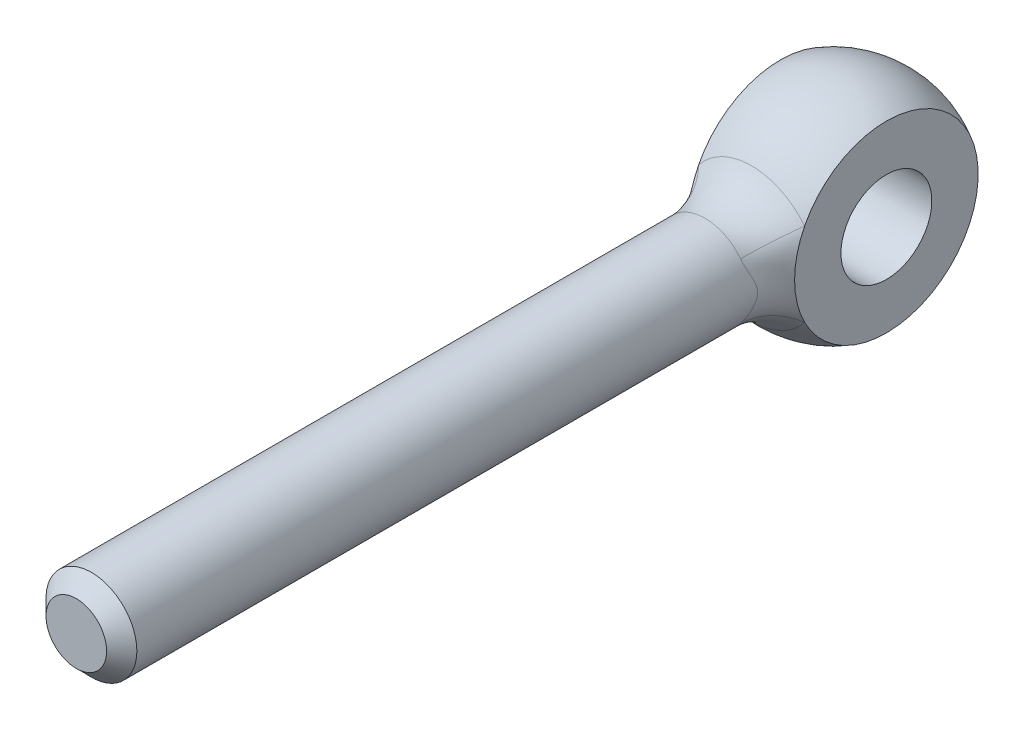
ISO-10303-21;
HEADER;
FILE_DESCRIPTION(('STEP AP214'),'2;1');
FILE_NAME('part.step','',(''),(''),'','','');
FILE_SCHEMA(('AUTOMOTIVE_DESIGN { 1 0 10303 214 1 1 1 1 }'));
ENDSEC;
DATA;
#1=APPLICATION_CONTEXT('core data for automotive mechanical design processes');
#2=APPLICATION_PROTOCOL_DEFINITION('international standard','automotive_design',2000,#1);
#3=PRODUCT_CONTEXT('',#1,'mechanical');
#4=PRODUCT('Part','Part','',(#3));
#5=PRODUCT_RELATED_PRODUCT_CATEGORY('part','',(#4));
#6=PRODUCT_DEFINITION_FORMATION('','',#4);
#7=PRODUCT_DEFINITION_CONTEXT('part definition',#1,'design');
#8=PRODUCT_DEFINITION('design','',#6,#7);
#9=PRODUCT_DEFINITION_SHAPE('','',#8);
#10=(LENGTH_UNIT() NAMED_UNIT(*) SI_UNIT(.MILLI.,.METRE.));
#11=(NAMED_UNIT(*) PLANE_ANGLE_UNIT() SI_UNIT($,.RADIAN.));
#12=(NAMED_UNIT(*) SI_UNIT($,.STERADIAN.) SOLID_ANGLE_UNIT());
#13=UNCERTAINTY_MEASURE_WITH_UNIT(LENGTH_MEASURE(1.E-05),#10,'distance_accuracy_value','');
#14=(GEOMETRIC_REPRESENTATION_CONTEXT(3) GLOBAL_UNCERTAINTY_ASSIGNED_CONTEXT((#13)) GLOBAL_UNIT_ASSIGNED_CONTEXT((#10,
#11,#12)) REPRESENTATION_CONTEXT('',''));
#15=CARTESIAN_POINT('',(0.,0.,0.));
#16=DIRECTION('',(0.,0.,1.));
#17=DIRECTION('',(1.,0.,0.));
#18=AXIS2_PLACEMENT_3D('',#15,#16,#17);
#19=CARTESIAN_POINT('',(0.,0.,0.));
#20=DIRECTION('',(-1.,0.,0.));
#21=DIRECTION('',(0.,0.,-1.));
#22=AXIS2_PLACEMENT_3D('',#19,#20,#21);
#23=SPHERICAL_SURFACE('',#22,7.);
#24=CARTESIAN_POINT('',(3.5,0.,0.));
#25=DIRECTION('',(1.,0.,0.));
#26=DIRECTION('',(0.,0.,1.));
#27=AXIS2_PLACEMENT_3D('',#24,#25,#26);
#28=CIRCLE('',#27,6.06217782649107);
#29=CARTESIAN_POINT('',(3.5,2.75553537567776,5.39972451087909));
#30=VERTEX_POINT('',#29);
#31=CARTESIAN_POINT('',(3.5,-2.75553537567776,5.39972451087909));
#32=VERTEX_POINT('',#31);
#33=EDGE_CURVE('E64',#30,#32,#28,.F.);
#34=ORIENTED_EDGE('',*,*,#33,.T.);
#35=CARTESIAN_POINT('',(0.,0.,5.39972451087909));
#36=DIRECTION('',(0.,0.,-1.));
#37=DIRECTION('',(1.,0.,0.));
#38=AXIS2_PLACEMENT_3D('',#35,#36,#37);
#39=CIRCLE('',#38,4.45454545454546);
#40=CARTESIAN_POINT('',(-3.5,-2.75553537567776,5.39972451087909));
#41=VERTEX_POINT('',#40);
#42=EDGE_CURVE('E72',#32,#41,#39,.T.);
#43=ORIENTED_EDGE('',*,*,#42,.T.);
#44=CARTESIAN_POINT('',(-3.5,0.,0.));
#45=DIRECTION('',(1.,0.,0.));
#46=DIRECTION('',(0.,0.,1.));
#47=AXIS2_PLACEMENT_3D('',#44,#45,#46);
#48=CIRCLE('',#47,6.06217782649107);
#49=CARTESIAN_POINT('',(-3.5,2.75553537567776,5.39972451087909));
#50=VERTEX_POINT('',#49);
#51=EDGE_CURVE('E60',#50,#41,#48,.F.);
#52=ORIENTED_EDGE('',*,*,#51,.F.);
#53=CARTESIAN_POINT('',(0.,0.,5.39972451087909));
#54=DIRECTION('',(0.,0.,-1.));
#55=DIRECTION('',(1.,0.,0.));
#56=AXIS2_PLACEMENT_3D('',#53,#54,#55);
#57=CIRCLE('',#56,4.45454545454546);
#58=EDGE_CURVE('E69',#50,#30,#57,.T.);
#59=ORIENTED_EDGE('',*,*,#58,.T.);
#60=EDGE_LOOP('',(#34,#43,#52,#59));
#61=FACE_BOUND('',#60,.T.);
#62=ADVANCED_FACE('F14',(#61),#23,.T.);
#63=CARTESIAN_POINT('',(0.,0.,-10.));
#64=DIRECTION('',(0.,0.,-1.));
#65=DIRECTION('',(1.,0.,0.));
#66=AXIS2_PLACEMENT_3D('',#63,#64,#65);
#67=CYLINDRICAL_SURFACE('',#66,3.);
#68=CARTESIAN_POINT('',(3.5,3.2355782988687,5.12650300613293));
#69=CARTESIAN_POINT('',(2.21863331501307,2.04715505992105,6.30296014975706));
#70=CARTESIAN_POINT('',(1.96436370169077,2.26743803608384,8.38265343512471));
#71=CARTESIAN_POINT('',(3.5,3.19913440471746,5.14950105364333));
#72=CARTESIAN_POINT('',(2.22557997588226,2.03413369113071,6.33043158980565));
#73=CARTESIAN_POINT('',(2.00002659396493,2.23654422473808,8.40046287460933));
#74=CARTESIAN_POINT('',(3.5,3.16190695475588,5.17245733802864));
#75=CARTESIAN_POINT('',(2.23371605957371,2.02068666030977,6.35734290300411));
#76=CARTESIAN_POINT('',(2.0350744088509,2.20470514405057,8.41580330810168));
#77=CARTESIAN_POINT('',(3.5,3.08569578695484,5.2182818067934));
#78=CARTESIAN_POINT('',(2.25234735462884,1.99246404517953,6.40983640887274));
#79=CARTESIAN_POINT('',(2.10377448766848,2.13924810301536,8.44176635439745));
#80=CARTESIAN_POINT('',(3.5,3.04671284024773,5.24115002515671));
#81=CARTESIAN_POINT('',(2.26283033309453,1.97769838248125,6.43541471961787));
#82=CARTESIAN_POINT('',(2.13742735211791,2.10563092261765,8.45239101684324));
#83=CARTESIAN_POINT('',(3.5,2.92713810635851,5.30945187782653));
#84=CARTESIAN_POINT('',(2.29762891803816,1.9308753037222,6.50965537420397));
#85=CARTESIAN_POINT('',(2.23581231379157,2.00253050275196,8.47747005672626));
#86=CARTESIAN_POINT('',(3.5,2.84361463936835,5.35477773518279));
#87=CARTESIAN_POINT('',(2.32540834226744,1.89608630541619,6.55631945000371));
#88=CARTESIAN_POINT('',(2.29827584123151,1.93053455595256,8.48527657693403));
#89=CARTESIAN_POINT('',(3.5,2.68828049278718,5.43404462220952));
#90=CARTESIAN_POINT('',(2.38119716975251,1.82520856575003,6.63251730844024));
#91=CARTESIAN_POINT('',(2.40209207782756,1.79867960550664,8.48528503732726));
#92=CARTESIAN_POINT('',(3.5,2.61836938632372,5.46814371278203));
#93=CARTESIAN_POINT('',(2.40751211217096,1.7914868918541,6.66344728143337));
#94=CARTESIAN_POINT('',(2.44494437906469,1.73997552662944,8.48073996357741));
#95=CARTESIAN_POINT('',(3.5,2.47253010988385,5.53561665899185));
#96=CARTESIAN_POINT('',(2.46336082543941,1.71657198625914,6.72077052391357));
#97=CARTESIAN_POINT('',(2.52619122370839,1.61975821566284,8.46374010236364));
#98=CARTESIAN_POINT('',(3.5,2.39660211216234,5.56899053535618));
#99=CARTESIAN_POINT('',(2.49286593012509,1.67543815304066,6.74718644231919));
#100=CARTESIAN_POINT('',(2.56458589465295,1.55824506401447,8.45128554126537));
#101=CARTESIAN_POINT('',(3.5,2.23774111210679,5.63470809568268));
#102=CARTESIAN_POINT('',(2.5537200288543,1.58464459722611,6.79524626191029));
#103=CARTESIAN_POINT('',(2.63684802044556,1.43258848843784,8.41976991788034));
#104=CARTESIAN_POINT('',(3.5,2.15478066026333,5.66704699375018));
#105=CARTESIAN_POINT('',(2.58506432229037,1.53500719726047,6.81690296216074));
#106=CARTESIAN_POINT('',(2.67069626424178,1.36843531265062,8.40068197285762));
#107=CARTESIAN_POINT('',(3.5,1.98146058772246,5.72994859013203));
#108=CARTESIAN_POINT('',(2.64778994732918,1.42682558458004,6.85520056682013));
#109=CARTESIAN_POINT('',(2.73354742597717,1.23812374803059,8.3575760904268));
#110=CARTESIAN_POINT('',(3.5,1.89110305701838,5.76051178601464));
#111=CARTESIAN_POINT('',(2.67917754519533,1.36833105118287,6.87187976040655));
#112=CARTESIAN_POINT('',(2.762551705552,1.17196592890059,8.33355954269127));
#113=CARTESIAN_POINT('',(3.5,1.69949261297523,5.81997315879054));
#114=CARTESIAN_POINT('',(2.74115773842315,1.24039026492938,6.9008364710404));
#115=CARTESIAN_POINT('',(2.81645383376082,1.03590679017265,8.28185197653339));
#116=CARTESIAN_POINT('',(3.5,1.59799422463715,5.84879391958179));
#117=CARTESIAN_POINT('',(2.77173084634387,1.17068445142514,6.91300893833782));
#118=CARTESIAN_POINT('',(2.84120245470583,0.965952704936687,8.25407236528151));
#119=CARTESIAN_POINT('',(3.5,1.38590398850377,5.90264647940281));
#120=CARTESIAN_POINT('',(2.82915481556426,1.0218711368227,6.93279113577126));
#121=CARTESIAN_POINT('',(2.88545377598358,0.824412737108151,8.19818783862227));
#122=CARTESIAN_POINT('',(3.5,1.27531024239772,5.92767748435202));
#123=CARTESIAN_POINT('',(2.85604865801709,0.94275603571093,6.94043354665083));
#124=CARTESIAN_POINT('',(2.90495537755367,0.752826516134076,8.17008285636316));
#125=CARTESIAN_POINT('',(3.5,1.04560560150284,5.97246327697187));
#126=CARTESIAN_POINT('',(2.90411065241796,0.776315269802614,6.95205804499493));
#127=CARTESIAN_POINT('',(2.93855908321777,0.608547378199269,8.11713526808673));
#128=CARTESIAN_POINT('',(3.5,0.926538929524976,5.99224322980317));
#129=CARTESIAN_POINT('',(2.92535761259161,0.688982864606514,6.95608079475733));
#130=CARTESIAN_POINT('',(2.9526870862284,0.535861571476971,8.09227740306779));
#131=CARTESIAN_POINT('',(3.5,0.68054307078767,6.02513117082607));
#132=CARTESIAN_POINT('',(2.96054851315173,0.507403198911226,6.96172989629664));
#133=CARTESIAN_POINT('',(2.97556066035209,0.389275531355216,8.04961466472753));
#134=CARTESIAN_POINT('',(3.5,0.553617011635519,6.03824179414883));
#135=CARTESIAN_POINT('',(2.97454461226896,0.413055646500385,6.96336925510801));
#136=CARTESIAN_POINT('',(2.98430835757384,0.315375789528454,8.03180700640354));
#137=CARTESIAN_POINT('',(3.5,0.303921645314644,6.05575319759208));
#138=CARTESIAN_POINT('',(2.99317980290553,0.227057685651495,6.9653314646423));
#139=CARTESIAN_POINT('',(2.99586345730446,0.172039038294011,8.00773261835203));
#140=CARTESIAN_POINT('',(3.5,0.181493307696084,6.06070443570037));
#141=CARTESIAN_POINT('',(2.99843655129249,0.135573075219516,6.96574247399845));
#142=CARTESIAN_POINT('',(2.99904725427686,0.102656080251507,8.00073868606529));
#143=CARTESIAN_POINT('',(3.5,-0.0639922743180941,6.06308183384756));
#144=CARTESIAN_POINT('',(3.00095906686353,-0.0477841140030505,6.96595496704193));
#145=CARTESIAN_POINT('',(3.00058476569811,-0.0362059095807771,7.99740043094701));
#146=CARTESIAN_POINT('',(3.5,-0.187049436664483,6.06050895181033));
#147=CARTESIAN_POINT('',(2.99822972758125,-0.139797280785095,6.96575683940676));
#148=CARTESIAN_POINT('',(2.99893909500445,-0.105684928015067,8.00105475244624));
#149=CARTESIAN_POINT('',(3.5,-0.430433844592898,6.04811255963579));
#150=CARTESIAN_POINT('',(2.98505607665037,-0.321332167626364,6.96450271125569));
#151=CARTESIAN_POINT('',(2.99083776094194,-0.244419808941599,8.01827198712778));
#152=CARTESIAN_POINT('',(3.5,-0.550747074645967,6.03825791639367));
#153=CARTESIAN_POINT('',(2.97455895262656,-0.410973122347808,6.96344099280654));
#154=CARTESIAN_POINT('',(2.9843614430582,-0.313673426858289,8.03187744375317));
#155=CARTESIAN_POINT('',(3.5,-0.785277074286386,6.01226238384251));
#156=CARTESIAN_POINT('',(2.94680070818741,-0.584817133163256,6.95963906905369));
#157=CARTESIAN_POINT('',(2.96668099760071,-0.45124086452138,8.06646091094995));
#158=CARTESIAN_POINT('',(3.5,-0.89949101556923,5.99611860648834));
#159=CARTESIAN_POINT('',(2.92950006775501,-0.669117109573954,6.95689108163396));
#160=CARTESIAN_POINT('',(2.95547469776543,-0.519554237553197,8.08744230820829));
#161=CARTESIAN_POINT('',(3.5,-1.14466587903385,5.95469892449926));
#162=CARTESIAN_POINT('',(2.8850519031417,-0.84851443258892,6.94781605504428));
#163=CARTESIAN_POINT('',(2.92546212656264,-0.669905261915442,8.13862044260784));
#164=CARTESIAN_POINT('',(3.5,-1.2737777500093,5.92819498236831));
#165=CARTESIAN_POINT('',(2.85652720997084,-0.941906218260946,6.94081419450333));
#166=CARTESIAN_POINT('',(2.90552581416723,-0.751653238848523,8.16982905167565));
#167=CARTESIAN_POINT('',(3.5,-1.52022594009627,5.86983635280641));
#168=CARTESIAN_POINT('',(2.7940966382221,-1.116761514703,6.92132179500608));
#169=CARTESIAN_POINT('',(2.85888787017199,-0.913139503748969,8.23302910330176));
#170=CARTESIAN_POINT('',(3.5,-1.6375610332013,5.83798110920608));
#171=CARTESIAN_POINT('',(2.76012134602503,-1.19824949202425,6.90878561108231));
#172=CARTESIAN_POINT('',(2.83218553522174,-0.992877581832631,8.26502062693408));
#173=CARTESIAN_POINT('',(3.5,-1.86074281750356,5.77071693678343));
#174=CARTESIAN_POINT('',(2.68964762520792,-1.3486745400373,6.87736168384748));
#175=CARTESIAN_POINT('',(2.77218396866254,-1.14979424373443,8.32543949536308));
#176=CARTESIAN_POINT('',(3.5,-1.96662566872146,5.73531991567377));
#177=CARTESIAN_POINT('',(2.65311349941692,-1.41761828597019,6.85843776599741));
#178=CARTESIAN_POINT('',(2.73890649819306,-1.22698031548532,8.35387810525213));
#179=CARTESIAN_POINT('',(3.5,-2.16831663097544,5.66214700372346));
#180=CARTESIAN_POINT('',(2.58013760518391,-1.54353013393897,6.81390806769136));
#181=CARTESIAN_POINT('',(2.66580809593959,-1.37860218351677,8.40405685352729));
#182=CARTESIAN_POINT('',(3.5,-2.26412770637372,5.62437181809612));
#183=CARTESIAN_POINT('',(2.54368572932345,-1.60042771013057,6.78824595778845));
#184=CARTESIAN_POINT('',(2.62598909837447,-1.45303878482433,8.42579896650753));
#185=CARTESIAN_POINT('',(3.5,-2.42732492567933,5.5555531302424));
#186=CARTESIAN_POINT('',(2.48097334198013,-1.69214647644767,6.73662730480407));
#187=CARTESIAN_POINT('',(2.54917488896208,-1.58307726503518,8.45638664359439));
#188=CARTESIAN_POINT('',(3.5,-2.49642063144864,5.52478816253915));
#189=CARTESIAN_POINT('',(2.45416730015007,-1.72909797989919,6.71183508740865));
#190=CARTESIAN_POINT('',(2.51338258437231,-1.63931580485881,8.46699219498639));
#191=CARTESIAN_POINT('',(3.5,-2.62956489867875,5.4626716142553));
#192=CARTESIAN_POINT('',(2.40331863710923,-1.79685748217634,6.65848651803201));
#193=CARTESIAN_POINT('',(2.43805487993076,-1.74938114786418,8.48143646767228));
#194=CARTESIAN_POINT('',(3.5,-2.69361495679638,5.43132021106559));
#195=CARTESIAN_POINT('',(2.37929807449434,-1.82762171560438,6.6299143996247));
#196=CARTESIAN_POINT('',(2.39852059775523,-1.80320866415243,8.48527720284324));
#197=CARTESIAN_POINT('',(3.5,-2.8177780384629,5.36796438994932));
#198=CARTESIAN_POINT('',(2.33474131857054,-1.88422869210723,6.56907584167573));
#199=CARTESIAN_POINT('',(2.31554978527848,-1.90860230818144,8.48528557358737));
#200=CARTESIAN_POINT('',(3.5,-2.8778482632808,5.33595660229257));
#201=CARTESIAN_POINT('',(2.31427267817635,-1.90997795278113,6.53677079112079));
#202=CARTESIAN_POINT('',(2.27207998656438,-1.96014233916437,8.48138054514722));
#203=CARTESIAN_POINT('',(3.5,-2.9939512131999,5.27168077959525));
#204=CARTESIAN_POINT('',(2.2776511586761,-1.95742199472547,6.46905580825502));
#205=CARTESIAN_POINT('',(2.18187152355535,-2.06009596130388,8.46496397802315));
#206=CARTESIAN_POINT('',(3.5,-3.04997999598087,5.23941252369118));
#207=CARTESIAN_POINT('',(2.26153651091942,-1.97907719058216,6.4336448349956));
#208=CARTESIAN_POINT('',(2.13512975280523,-2.10850649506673,8.45244415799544));
#209=CARTESIAN_POINT('',(3.5,-3.10421473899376,5.20709620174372));
#210=CARTESIAN_POINT('',(2.2479190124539,-1.99926699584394,6.39701307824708));
#211=CARTESIAN_POINT('',(2.08694971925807,-2.15514288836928,8.43522555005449));
#212=(BOUNDED_SURFACE() B_SPLINE_SURFACE(3,2,((#68,#69,#70),(#71,#72,#73),(#74,#75,#76),(#77,
#78,#79),(#80,#81,#82),(#83,#84,#85),(#86,#87,#88),(#89,#90,#91),(#92,#93,#94),(#95,#96,#97),
(#98,#99,#100),(#101,#102,#103),(#104,#105,#106),(#107,#108,#109),(#110,#111,#112),(#113,#114,
#115),(#116,#117,#118),(#119,#120,#121),(#122,#123,#124),(#125,#126,#127),(#128,#129,#130),
(#131,#132,#133),(#134,#135,#136),(#137,#138,#139),(#140,#141,#142),(#143,#144,#145),(#146,#147,
#148),(#149,#150,#151),(#152,#153,#154),(#155,#156,#157),(#158,#159,#160),(#161,#162,#163),
(#164,#165,#166),(#167,#168,#169),(#170,#171,#172),(#173,#174,#175),(#176,#177,#178),(#179,#180,
#181),(#182,#183,#184),(#185,#186,#187),(#188,#189,#190),(#191,#192,#193),(#194,#195,#196),
(#197,#198,#199),(#200,#201,#202),(#203,#204,#205),(#206,#207,#208),(#209,#210,#211)),
.UNSPECIFIED.,.F.,.F.,.F.) B_SPLINE_SURFACE_WITH_KNOTS((4,2,2,2,2,2,2,2,2,2,2,2,2,2,2,2,2,2,2,2,
2,2,2,4),(3,3),(0.,0.334444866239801,0.668744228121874,1.33450545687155,1.84286226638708,
2.35120452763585,2.86163141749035,3.37191458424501,3.8975002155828,4.42319582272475,
4.94632464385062,5.46924660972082,5.95518232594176,6.4410561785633,6.92901948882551,
7.41720714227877,8.01287518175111,8.60860516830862,9.20239558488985,9.79601074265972,
10.2632772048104,10.7304045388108,11.201934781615,11.6739189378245),(0.,1.),
.UNSPECIFIED.) GEOMETRIC_REPRESENTATION_ITEM() RATIONAL_B_SPLINE_SURFACE(((1.,0.884784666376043,
1.),(1.,0.88614464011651,1.),(1.,0.887587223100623,1.),(1.,0.890623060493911,1.),(1.,
0.892216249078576,1.),(1.,0.897187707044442,1.),(1.,0.900769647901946,1.),(1.,0.907408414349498,
1.),(1.,0.910389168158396,1.),(1.,0.916470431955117,1.),(1.,0.91957093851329,1.),(1.,
0.925799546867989,1.),(1.,0.928927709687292,1.),(1.,0.935083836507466,1.),(1.,0.938111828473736,
1.),(1.,0.944034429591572,1.),(1.,0.946922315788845,1.),(1.,0.952322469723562,1.),(1.,
0.954834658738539,1.),(1.,0.959320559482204,1.),(1.,0.961296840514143,1.),(1.,0.964574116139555,
1.),(1.,0.965875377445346,1.),(1.,0.967610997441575,1.),(1.,0.968100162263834,1.),(1.,
0.9683352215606,1.),(1.,0.968081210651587,1.),(1.,0.966853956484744,1.),(1.,0.965877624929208,
1.),(1.,0.96329273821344,1.),(1.,0.961683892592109,1.),(1.,0.957543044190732,1.),(1.,
0.954885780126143,1.),(1.,0.949031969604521,1.),(1.,0.945835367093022,1.),(1.,0.939123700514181,
1.),(1.,0.935609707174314,1.),(1.,0.928447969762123,1.),(1.,0.924800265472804,1.),(1.,
0.918321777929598,1.),(1.,0.915482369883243,1.),(1.,0.909911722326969,1.),(1.,0.907180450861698,
1.),(1.,0.901873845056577,1.),(1.,0.89930022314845,1.),(1.,0.894395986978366,1.),(1.,
0.892065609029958,1.),(1.,0.889888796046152,1.))) REPRESENTATION_ITEM('') SURFACE());
#213=CARTESIAN_POINT('',(2.08694971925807,-2.15514288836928,8.43522555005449));
#214=CARTESIAN_POINT('',(2.13512975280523,-2.10850649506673,8.45244415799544));
#215=CARTESIAN_POINT('',(2.18187152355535,-2.06009596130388,8.46496397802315));
#216=CARTESIAN_POINT('',(2.27207998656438,-1.96014233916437,8.48138054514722));
#217=CARTESIAN_POINT('',(2.31554978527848,-1.90860230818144,8.48528557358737));
#218=CARTESIAN_POINT('',(2.39852059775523,-1.80320866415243,8.48527720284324));
#219=CARTESIAN_POINT('',(2.43805487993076,-1.74938114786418,8.48143646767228));
#220=CARTESIAN_POINT('',(2.51338258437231,-1.63931580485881,8.46699219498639));
#221=CARTESIAN_POINT('',(2.54917488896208,-1.58307726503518,8.45638664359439));
#222=CARTESIAN_POINT('',(2.62598909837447,-1.45303878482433,8.42579896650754));
#223=CARTESIAN_POINT('',(2.66580809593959,-1.37860218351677,8.40405685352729));
#224=CARTESIAN_POINT('',(2.73890649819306,-1.22698031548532,8.35387810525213));
#225=CARTESIAN_POINT('',(2.77218396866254,-1.14979424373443,8.32543949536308));
#226=CARTESIAN_POINT('',(2.83218553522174,-0.992877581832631,8.26502062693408));
#227=CARTESIAN_POINT('',(2.85888787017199,-0.913139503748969,8.23302910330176));
#228=CARTESIAN_POINT('',(2.90552581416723,-0.751653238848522,8.16982905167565));
#229=CARTESIAN_POINT('',(2.92546212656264,-0.669905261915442,8.13862044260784));
#230=CARTESIAN_POINT('',(2.95547469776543,-0.519554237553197,8.08744230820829));
#231=CARTESIAN_POINT('',(2.96668099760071,-0.45124086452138,8.06646091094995));
#232=CARTESIAN_POINT('',(2.9843614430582,-0.313673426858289,8.03187744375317));
#233=CARTESIAN_POINT('',(2.99083776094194,-0.244419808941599,8.01827198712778));
#234=CARTESIAN_POINT('',(2.99893909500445,-0.105684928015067,8.00105475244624));
#235=CARTESIAN_POINT('',(3.00058476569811,-0.0362059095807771,7.99740043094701));
#236=CARTESIAN_POINT('',(2.99904725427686,0.102656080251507,8.00073868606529));
#237=CARTESIAN_POINT('',(2.99586345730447,0.172039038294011,8.00773261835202));
#238=CARTESIAN_POINT('',(2.98430835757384,0.315375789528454,8.03180700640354));
#239=CARTESIAN_POINT('',(2.97556066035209,0.389275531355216,8.04961466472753));
#240=CARTESIAN_POINT('',(2.9526870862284,0.535861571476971,8.09227740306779));
#241=CARTESIAN_POINT('',(2.93855908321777,0.608547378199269,8.11713526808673));
#242=CARTESIAN_POINT('',(2.90495537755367,0.752826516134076,8.17008285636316));
#243=CARTESIAN_POINT('',(2.88545377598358,0.824412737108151,8.19818783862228));
#244=CARTESIAN_POINT('',(2.84120245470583,0.965952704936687,8.25407236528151));
#245=CARTESIAN_POINT('',(2.81645383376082,1.03590679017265,8.28185197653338));
#246=CARTESIAN_POINT('',(2.762551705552,1.17196592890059,8.33355954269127));
#247=CARTESIAN_POINT('',(2.73354742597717,1.23812374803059,8.3575760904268));
#248=CARTESIAN_POINT('',(2.67069626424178,1.36843531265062,8.40068197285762));
#249=CARTESIAN_POINT('',(2.63684802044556,1.43258848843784,8.41976991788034));
#250=CARTESIAN_POINT('',(2.56458589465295,1.55824506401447,8.45128554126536));
#251=CARTESIAN_POINT('',(2.52619122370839,1.61975821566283,8.46374010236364));
#252=CARTESIAN_POINT('',(2.44494437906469,1.73997552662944,8.48073996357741));
#253=CARTESIAN_POINT('',(2.40209207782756,1.79867960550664,8.48528503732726));
#254=CARTESIAN_POINT('',(2.29827584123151,1.93053455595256,8.48527657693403));
#255=CARTESIAN_POINT('',(2.23581231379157,2.00253050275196,8.47747005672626));
#256=CARTESIAN_POINT('',(2.13742735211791,2.10563092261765,8.45239101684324));
#257=CARTESIAN_POINT('',(2.10377448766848,2.13924810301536,8.44176635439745));
#258=CARTESIAN_POINT('',(2.0350744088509,2.20470514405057,8.41580330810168));
#259=CARTESIAN_POINT('',(2.00002659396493,2.23654422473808,8.40046287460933));
#260=CARTESIAN_POINT('',(1.96436370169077,2.26743803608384,8.38265343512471));
#261=B_SPLINE_CURVE_WITH_KNOTS('',3,(#213,#214,#215,#216,#217,#218,#219,#220,#221,#222,#223,
#224,#225,#226,#227,#228,#229,#230,#231,#232,#233,#234,#235,#236,#237,#238,#239,#240,#241,#242,
#243,#244,#245,#246,#247,#248,#249,#250,#251,#252,#253,#254,#255,#256,#257,#258,#259,#260),
.UNSPECIFIED.,.F.,.F.,(4,2,2,2,2,2,2,2,2,2,2,2,2,2,2,2,2,2,2,2,2,2,2,4),(0.,0.471984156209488,
0.943514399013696,1.41064173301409,1.87790819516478,2.47152335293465,3.06531376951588,
3.66104375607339,4.25671179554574,4.744899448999,5.2328627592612,5.71873661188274,
6.20467232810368,6.72759429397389,7.25072311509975,7.7764187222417,8.30200435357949,
8.81228752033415,9.32271441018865,9.83105667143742,10.3394134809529,11.0051747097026,
11.3394740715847,11.6739189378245),.UNSPECIFIED.);
#262=CARTESIAN_POINT('',(2.35714285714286,-1.85576872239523,8.48528137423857));
#263=VERTEX_POINT('',#262);
#264=CARTESIAN_POINT('',(2.35714285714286,1.85576872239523,8.48528137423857));
#265=VERTEX_POINT('',#264);
#266=EDGE_CURVE('E87',#263,#265,#261,.T.);
#267=ORIENTED_EDGE('',*,*,#266,.T.);
#268=CARTESIAN_POINT('',(0.,0.,8.48528137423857));
#269=DIRECTION('',(0.,0.,-1.));
#270=DIRECTION('',(1.,0.,0.));
#271=AXIS2_PLACEMENT_3D('',#268,#269,#270);
#272=CIRCLE('',#271,3.);
#273=CARTESIAN_POINT('',(-2.35714285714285,1.85576872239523,8.48528137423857));
#274=VERTEX_POINT('',#273);
#275=EDGE_CURVE('E9',#265,#274,#272,.F.);
#276=ORIENTED_EDGE('',*,*,#275,.T.);
#277=CARTESIAN_POINT('',(-3.5,-3.2355783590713,5.12650296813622));
#278=CARTESIAN_POINT('',(-2.21863329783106,-2.04715507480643,6.30296011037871));
#279=CARTESIAN_POINT('',(-1.96436370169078,-2.26743803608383,8.38265343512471));
#280=CARTESIAN_POINT('',(-3.5,-3.19913442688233,5.14950103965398));
#281=CARTESIAN_POINT('',(-2.22557996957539,-2.03413369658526,6.33043157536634));
#282=CARTESIAN_POINT('',(-2.00002659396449,-2.23654422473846,8.40046287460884));
#283=CARTESIAN_POINT('',(-3.5,-3.16190696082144,5.17245733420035));
#284=CARTESIAN_POINT('',(-2.23371605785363,-2.02068666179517,6.35734289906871));
#285=CARTESIAN_POINT('',(-2.03507440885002,-2.20470514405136,8.41580330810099));
#286=CARTESIAN_POINT('',(-3.5,-3.0856957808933,5.21828181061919));
#287=CARTESIAN_POINT('',(-2.25234735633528,-1.99246404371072,6.40983641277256));
#288=CARTESIAN_POINT('',(-2.10377448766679,-2.13924810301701,8.44176635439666));
#289=CARTESIAN_POINT('',(-3.5,-3.04671283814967,5.24115002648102));
#290=CARTESIAN_POINT('',(-2.2628303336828,-1.9776983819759,6.4354147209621));
#291=CARTESIAN_POINT('',(-2.13742735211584,-2.10563092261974,8.45239101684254));
#292=CARTESIAN_POINT('',(-3.5,-2.92713811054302,5.30945187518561));
#293=CARTESIAN_POINT('',(-2.29762891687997,-1.93087530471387,6.50965537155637));
#294=CARTESIAN_POINT('',(-2.23581231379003,-2.00253050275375,8.47747005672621));
#295=CARTESIAN_POINT('',(-3.5,-2.84361464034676,5.35477773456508));
#296=CARTESIAN_POINT('',(-2.32540834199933,-1.89608630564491,6.5563194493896));
#297=CARTESIAN_POINT('',(-2.29827584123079,-1.93053455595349,8.48527657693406));
#298=CARTESIAN_POINT('',(-3.5,-2.68828049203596,5.4340446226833));
#299=CARTESIAN_POINT('',(-2.38119716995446,-1.8252085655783,6.6325173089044));
#300=CARTESIAN_POINT('',(-2.40209207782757,-1.79867960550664,8.48528503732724));
#301=CARTESIAN_POINT('',(-3.5,-2.61836938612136,5.46814371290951));
#302=CARTESIAN_POINT('',(-2.40751211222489,-1.79148689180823,6.66344728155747));
#303=CARTESIAN_POINT('',(-2.44494437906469,-1.73997552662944,8.4807399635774));
#304=CARTESIAN_POINT('',(-3.5,-2.47253011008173,5.53561665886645));
#305=CARTESIAN_POINT('',(-2.46336082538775,-1.71657198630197,6.72077052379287));
#306=CARTESIAN_POINT('',(-2.52619122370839,-1.61975821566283,8.46374010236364));
#307=CARTESIAN_POINT('',(-3.5,-2.39660211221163,5.56899053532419));
#308=CARTESIAN_POINT('',(-2.49286593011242,-1.67543815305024,6.74718644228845));
#309=CARTESIAN_POINT('',(-2.56458589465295,-1.55824506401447,8.45128554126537));
#310=CARTESIAN_POINT('',(-3.5,-2.23774111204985,5.63470809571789));
#311=CARTESIAN_POINT('',(-2.55372002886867,-1.58464459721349,6.79524626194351));
#312=CARTESIAN_POINT('',(-2.63684802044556,-1.43258848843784,8.41976991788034));
#313=CARTESIAN_POINT('',(-3.5,-2.15478066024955,5.66704699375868));
#314=CARTESIAN_POINT('',(-2.58506432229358,-1.53500719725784,6.81690296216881));
#315=CARTESIAN_POINT('',(-2.67069626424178,-1.36843531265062,8.40068197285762));
#316=CARTESIAN_POINT('',(-3.5,-1.98146058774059,5.72994859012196));
#317=CARTESIAN_POINT('',(-2.64778994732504,-1.42682558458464,6.85520056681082));
#318=CARTESIAN_POINT('',(-2.73354742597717,-1.23812374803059,8.35757609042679));
#319=CARTESIAN_POINT('',(-3.5,-1.89110305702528,5.76051178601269));
#320=CARTESIAN_POINT('',(-2.67917754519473,-1.36833105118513,6.87187976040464));
#321=CARTESIAN_POINT('',(-2.762551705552,-1.17196592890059,8.33355954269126));
#322=CARTESIAN_POINT('',(-3.5,-1.69949261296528,5.81997315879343));
#323=CARTESIAN_POINT('',(-2.74115773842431,-1.24039026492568,6.90083647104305));
#324=CARTESIAN_POINT('',(-2.81645383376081,-1.03590679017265,8.28185197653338));
#325=CARTESIAN_POINT('',(-3.5,-1.59799422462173,5.84879391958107));
#326=CARTESIAN_POINT('',(-2.77173084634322,-1.17068445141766,6.91300893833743));
#327=CARTESIAN_POINT('',(-2.84120245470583,-0.965952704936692,8.25407236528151));
#328=CARTESIAN_POINT('',(-3.5,-1.38590398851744,5.90264647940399));
#329=CARTESIAN_POINT('',(-2.82915481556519,-1.02187113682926,6.93279113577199));
#330=CARTESIAN_POINT('',(-2.88545377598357,-0.824412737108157,8.19818783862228));
#331=CARTESIAN_POINT('',(-3.5,-1.27531024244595,5.92767748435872));
#332=CARTESIAN_POINT('',(-2.85604865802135,-0.942756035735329,6.94043354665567));
#333=CARTESIAN_POINT('',(-2.90495537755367,-0.75282651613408,8.17008285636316));
#334=CARTESIAN_POINT('',(-3.5,-1.04560560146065,5.97246327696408));
#335=CARTESIAN_POINT('',(-2.90411065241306,-0.776315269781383,6.9520580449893));
#336=CARTESIAN_POINT('',(-2.93855908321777,-0.608547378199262,8.11713526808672));
#337=CARTESIAN_POINT('',(-3.5,-0.926538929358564,5.99224322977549));
#338=CARTESIAN_POINT('',(-2.92535761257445,-0.68898286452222,6.95608079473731));
#339=CARTESIAN_POINT('',(-2.95268708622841,-0.535861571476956,8.09227740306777));
#340=CARTESIAN_POINT('',(-3.5,-0.680543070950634,6.02513117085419));
#341=CARTESIAN_POINT('',(-2.96054851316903,-0.507403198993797,6.96172989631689));
#342=CARTESIAN_POINT('',(-2.9755606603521,-0.389275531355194,8.04961466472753));
#343=CARTESIAN_POINT('',(-3.5,-0.55361701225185,6.03824179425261));
#344=CARTESIAN_POINT('',(-2.97454461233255,-0.413055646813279,6.96336925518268));
#345=CARTESIAN_POINT('',(-2.98430835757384,-0.315375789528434,8.03180700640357));
#346=CARTESIAN_POINT('',(-3.5,-0.303921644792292,6.05575319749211));
#347=CARTESIAN_POINT('',(-2.99317980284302,-0.227057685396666,6.96533146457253));
#348=CARTESIAN_POINT('',(-2.99586345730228,-0.172039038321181,8.00773261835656));
#349=CARTESIAN_POINT('',(-3.5,-0.18149330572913,6.06070443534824));
#350=CARTESIAN_POINT('',(-2.99843655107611,-0.135573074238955,6.9657424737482));
#351=CARTESIAN_POINT('',(-2.99904725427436,-0.10265608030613,8.00073868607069));
#352=CARTESIAN_POINT('',(-3.5,0.0639922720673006,6.0630818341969));
#353=CARTESIAN_POINT('',(-3.00095906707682,0.0477841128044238,6.96595496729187));
#354=CARTESIAN_POINT('',(-3.00058476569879,0.0362059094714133,7.99740043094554));
#355=CARTESIAN_POINT('',(-3.5,0.187049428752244,6.06050895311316));
#356=CARTESIAN_POINT('',(-2.99822972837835,0.139797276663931,6.96575684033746));
#357=CARTESIAN_POINT('',(-2.99893909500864,0.105684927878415,8.00105475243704));
#358=CARTESIAN_POINT('',(-3.5,0.430433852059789,6.0481125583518));
#359=CARTESIAN_POINT('',(-2.98505607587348,0.321332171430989,6.96450271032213));
#360=CARTESIAN_POINT('',(-2.9908377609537,0.244419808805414,8.01827198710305));
#361=CARTESIAN_POINT('',(-3.5,0.5507471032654,6.03825791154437));
#362=CARTESIAN_POINT('',(-2.9745589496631,0.410973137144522,6.96344098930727));
#363=CARTESIAN_POINT('',(-2.98436144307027,0.313673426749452,8.03187744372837));
#364=CARTESIAN_POINT('',(-3.5,0.785277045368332,6.01226238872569));
#365=CARTESIAN_POINT('',(-2.94680071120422,0.584817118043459,6.95963907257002));
#366=CARTESIAN_POINT('',(-2.9666809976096,0.451240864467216,8.06646091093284));
#367=CARTESIAN_POINT('',(-3.5,0.899490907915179,5.996118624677));
#368=CARTESIAN_POINT('',(-2.92950007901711,0.669117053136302,6.95689109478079));
#369=CARTESIAN_POINT('',(-2.95547469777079,0.519554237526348,8.087442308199));
#370=CARTESIAN_POINT('',(-3.5,1.14466575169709,5.95469894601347));
#371=CARTESIAN_POINT('',(-2.88505191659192,0.848514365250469,6.94781607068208));
#372=CARTESIAN_POINT('',(-2.92546212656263,0.669905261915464,8.138620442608));
#373=CARTESIAN_POINT('',(-3.5,1.27377771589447,5.92819498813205));
#374=CARTESIAN_POINT('',(-2.85652721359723,0.941906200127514,6.9408141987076));
#375=CARTESIAN_POINT('',(-2.90552581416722,0.751653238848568,8.16982905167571));
#376=CARTESIAN_POINT('',(-3.5,1.52022597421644,5.86983634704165));
#377=CARTESIAN_POINT('',(-2.79409663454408,1.11676153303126,6.9213217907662));
#378=CARTESIAN_POINT('',(-2.85888787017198,0.91313950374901,8.23302910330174));
#379=CARTESIAN_POINT('',(-3.5,1.63756104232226,5.83798110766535));
#380=CARTESIAN_POINT('',(-2.76012134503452,1.19824949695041,6.90878560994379));
#381=CARTESIAN_POINT('',(-2.83218553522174,0.992877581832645,8.26502062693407));
#382=CARTESIAN_POINT('',(-3.5,1.86074280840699,5.77071693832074));
#383=CARTESIAN_POINT('',(-2.68964762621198,1.34867453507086,6.87736168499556));
#384=CARTESIAN_POINT('',(-2.77218396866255,1.14979424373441,8.32543949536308));
#385=CARTESIAN_POINT('',(-3.5,1.96662566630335,5.73531991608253));
#386=CARTESIAN_POINT('',(-2.65311349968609,1.4176182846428,6.85843776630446));
#387=CARTESIAN_POINT('',(-2.73890649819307,1.22698031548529,8.35387810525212));
#388=CARTESIAN_POINT('',(-3.5,2.16831663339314,5.66214700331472));
#389=CARTESIAN_POINT('',(-2.58013760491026,1.54353013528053,6.81390806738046));
#390=CARTESIAN_POINT('',(-2.6658080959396,1.37860218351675,8.40405685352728));
#391=CARTESIAN_POINT('',(-3.5,2.26412770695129,5.624371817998));
#392=CARTESIAN_POINT('',(-2.54368572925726,1.60042771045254,6.78824595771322));
#393=CARTESIAN_POINT('',(-2.62598909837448,1.45303878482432,8.42579896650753));
#394=CARTESIAN_POINT('',(-3.5,2.42732492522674,5.55555313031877));
#395=CARTESIAN_POINT('',(-2.48097334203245,1.69214647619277,6.73662730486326));
#396=CARTESIAN_POINT('',(-2.54917488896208,1.58307726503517,8.45638664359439));
#397=CARTESIAN_POINT('',(-3.5,2.49642063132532,5.52478816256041));
#398=CARTESIAN_POINT('',(-2.45416730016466,1.7290979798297,6.71183508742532));
#399=CARTESIAN_POINT('',(-2.51338258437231,1.63931580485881,8.4669921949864));
#400=CARTESIAN_POINT('',(-3.5,2.62956489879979,5.4626716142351));
#401=CARTESIAN_POINT('',(-2.4033186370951,1.79685748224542,6.65848651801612));
#402=CARTESIAN_POINT('',(-2.43805487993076,1.74938114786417,8.48143646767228));
#403=CARTESIAN_POINT('',(-3.5,2.69361495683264,5.43132021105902));
#404=CARTESIAN_POINT('',(-2.37929807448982,1.82762171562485,6.62991439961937));
#405=CARTESIAN_POINT('',(-2.39852059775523,1.80320866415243,8.48527720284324));
#406=CARTESIAN_POINT('',(-3.5,2.81777803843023,5.36796438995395));
#407=CARTESIAN_POINT('',(-2.33474131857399,1.8842286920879,6.56907584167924));
#408=CARTESIAN_POINT('',(-2.31554978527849,1.90860230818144,8.48528557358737));
#409=CARTESIAN_POINT('',(-3.5,2.87784826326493,5.33595660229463));
#410=CARTESIAN_POINT('',(-2.31427267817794,1.90997795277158,6.5367707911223));
#411=CARTESIAN_POINT('',(-2.27207998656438,1.96014233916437,8.48138054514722));
#412=CARTESIAN_POINT('',(-3.5,2.99395121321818,5.27168077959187));
#413=CARTESIAN_POINT('',(-2.27765115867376,1.95742199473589,6.46905580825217));
#414=CARTESIAN_POINT('',(-2.18187152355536,2.06009596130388,8.46496397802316));
#415=CARTESIAN_POINT('',(-3.5,3.0499799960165,5.23941252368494));
#416=CARTESIAN_POINT('',(-2.26153651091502,1.97907719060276,6.43364483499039));
#417=CARTESIAN_POINT('',(-2.13512975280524,2.10850649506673,8.45244415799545));
#418=CARTESIAN_POINT('',(-3.5,3.1042147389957,5.20709620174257));
#419=CARTESIAN_POINT('',(-2.24791901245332,1.99926699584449,6.3970130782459));
#420=CARTESIAN_POINT('',(-2.08694971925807,2.15514288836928,8.43522555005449));
#421=(BOUNDED_SURFACE() B_SPLINE_SURFACE(3,2,((#277,#278,#279),(#280,#281,#282),(#283,#284,
#285),(#286,#287,#288),(#289,#290,#291),(#292,#293,#294),(#295,#296,#297),(#298,#299,#300),
(#301,#302,#303),(#304,#305,#306),(#307,#308,#309),(#310,#311,#312),(#313,#314,#315),(#316,#317,
#318),(#319,#320,#321),(#322,#323,#324),(#325,#326,#327),(#328,#329,#330),(#331,#332,#333),
(#334,#335,#336),(#337,#338,#339),(#340,#341,#342),(#343,#344,#345),(#346,#347,#348),(#349,#350,
#351),(#352,#353,#354),(#355,#356,#357),(#358,#359,#360),(#361,#362,#363),(#364,#365,#366),
(#367,#368,#369),(#370,#371,#372),(#373,#374,#375),(#376,#377,#378),(#379,#380,#381),(#382,#383,
#384),(#385,#386,#387),(#388,#389,#390),(#391,#392,#393),(#394,#395,#396),(#397,#398,#399),
(#400,#401,#402),(#403,#404,#405),(#406,#407,#408),(#409,#410,#411),(#412,#413,#414),(#415,#416,
#417),(#418,#419,#420)),.UNSPECIFIED.,.F.,.F.,.F.) B_SPLINE_SURFACE_WITH_KNOTS((4,2,2,2,2,2,2,2,
2,2,2,2,2,2,2,2,2,2,2,2,2,2,2,4),(3,3),(0.,0.334444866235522,0.668744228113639,1.33450545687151,
1.84286226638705,2.35120452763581,2.86163141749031,3.37191458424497,3.89750021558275,
4.42319582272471,4.94632464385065,5.46924660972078,5.95518232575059,6.44105617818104,
6.92901948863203,7.4172071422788,8.01287518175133,8.60860516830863,9.20239558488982,
9.79601074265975,10.2632772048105,10.7304045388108,11.201934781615,11.6739189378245),(0.,1.),
.UNSPECIFIED.) GEOMETRIC_REPRESENTATION_ITEM() RATIONAL_B_SPLINE_SURFACE(((1.,0.884784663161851,
1.),(1.,0.886144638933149,1.),(1.,0.887587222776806,1.),(1.,0.890623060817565,1.),(1.,
0.892216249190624,1.),(1.,0.897187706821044,1.),(1.,0.900769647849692,1.),(1.,0.907408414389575,
1.),(1.,0.910389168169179,1.),(1.,0.916470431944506,1.),(1.,0.919570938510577,1.),(1.,
0.925799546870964,1.),(1.,0.928927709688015,1.),(1.,0.935083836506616,1.),(1.,0.938111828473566,
1.),(1.,0.944034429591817,1.),(1.,0.946922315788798,1.),(1.,0.952322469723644,1.),(1.,
0.954834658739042,1.),(1.,0.959320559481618,1.),(1.,0.961296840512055,1.),(1.,0.964574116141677,
1.),(1.,0.965875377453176,1.),(1.,0.967610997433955,1.),(1.,0.968100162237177,1.),(1.,
0.968335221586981,1.),(1.,0.96808121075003,1.),(1.,0.966853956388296,1.),(1.,0.965877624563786,
1.),(1.,0.963292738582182,1.),(1.,0.961683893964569,1.),(1.,0.957543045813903,1.),(1.,
0.954885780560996,1.),(1.,0.94903196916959,1.),(1.,0.945835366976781,1.),(1.,0.939123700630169,
1.),(1.,0.935609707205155,1.),(1.,0.928447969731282,1.),(1.,0.924800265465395,1.),(1.,
0.91832177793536,1.),(1.,0.915482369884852,1.),(1.,0.909911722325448,1.),(1.,0.907180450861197,
1.),(1.,0.901873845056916,1.),(1.,0.899300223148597,1.),(1.,0.894395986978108,1.),(1.,
0.892065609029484,1.),(1.,0.889888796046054,1.))) REPRESENTATION_ITEM('') SURFACE());
#422=CARTESIAN_POINT('',(-2.08694971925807,2.15514288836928,8.43522555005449));
#423=CARTESIAN_POINT('',(-2.13512975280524,2.10850649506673,8.45244415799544));
#424=CARTESIAN_POINT('',(-2.18187152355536,2.06009596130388,8.46496397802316));
#425=CARTESIAN_POINT('',(-2.27207998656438,1.96014233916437,8.48138054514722));
#426=CARTESIAN_POINT('',(-2.31554978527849,1.90860230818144,8.48528557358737));
#427=CARTESIAN_POINT('',(-2.39852059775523,1.80320866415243,8.48527720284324));
#428=CARTESIAN_POINT('',(-2.43805487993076,1.74938114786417,8.48143646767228));
#429=CARTESIAN_POINT('',(-2.51338258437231,1.63931580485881,8.4669921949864));
#430=CARTESIAN_POINT('',(-2.54917488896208,1.58307726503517,8.45638664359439));
#431=CARTESIAN_POINT('',(-2.62598909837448,1.45303878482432,8.42579896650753));
#432=CARTESIAN_POINT('',(-2.6658080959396,1.37860218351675,8.40405685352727));
#433=CARTESIAN_POINT('',(-2.73890649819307,1.22698031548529,8.35387810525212));
#434=CARTESIAN_POINT('',(-2.77218396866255,1.14979424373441,8.32543949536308));
#435=CARTESIAN_POINT('',(-2.83218553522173,0.992877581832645,8.26502062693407));
#436=CARTESIAN_POINT('',(-2.85888787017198,0.91313950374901,8.23302910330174));
#437=CARTESIAN_POINT('',(-2.90552581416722,0.751653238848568,8.16982905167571));
#438=CARTESIAN_POINT('',(-2.92546212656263,0.669905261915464,8.13862044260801));
#439=CARTESIAN_POINT('',(-2.95547469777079,0.519554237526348,8.08744230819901));
#440=CARTESIAN_POINT('',(-2.9666809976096,0.451240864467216,8.06646091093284));
#441=CARTESIAN_POINT('',(-2.98436144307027,0.313673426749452,8.03187744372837));
#442=CARTESIAN_POINT('',(-2.9908377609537,0.244419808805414,8.01827198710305));
#443=CARTESIAN_POINT('',(-2.99893909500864,0.105684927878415,8.00105475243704));
#444=CARTESIAN_POINT('',(-3.00058476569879,0.0362059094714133,7.99740043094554));
#445=CARTESIAN_POINT('',(-2.99904725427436,-0.10265608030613,8.00073868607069));
#446=CARTESIAN_POINT('',(-2.99586345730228,-0.172039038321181,8.00773261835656));
#447=CARTESIAN_POINT('',(-2.98430835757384,-0.315375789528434,8.03180700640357));
#448=CARTESIAN_POINT('',(-2.9755606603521,-0.389275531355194,8.04961466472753));
#449=CARTESIAN_POINT('',(-2.95268708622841,-0.535861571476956,8.09227740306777));
#450=CARTESIAN_POINT('',(-2.93855908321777,-0.608547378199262,8.11713526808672));
#451=CARTESIAN_POINT('',(-2.90495537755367,-0.75282651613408,8.17008285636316));
#452=CARTESIAN_POINT('',(-2.88545377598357,-0.824412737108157,8.19818783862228));
#453=CARTESIAN_POINT('',(-2.84120245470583,-0.965952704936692,8.25407236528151));
#454=CARTESIAN_POINT('',(-2.81645383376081,-1.03590679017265,8.28185197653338));
#455=CARTESIAN_POINT('',(-2.762551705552,-1.17196592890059,8.33355954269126));
#456=CARTESIAN_POINT('',(-2.73354742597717,-1.23812374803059,8.35757609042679));
#457=CARTESIAN_POINT('',(-2.67069626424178,-1.36843531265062,8.40068197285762));
#458=CARTESIAN_POINT('',(-2.63684802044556,-1.43258848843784,8.41976991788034));
#459=CARTESIAN_POINT('',(-2.56458589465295,-1.55824506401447,8.45128554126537));
#460=CARTESIAN_POINT('',(-2.52619122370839,-1.61975821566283,8.46374010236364));
#461=CARTESIAN_POINT('',(-2.44494437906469,-1.73997552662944,8.4807399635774));
#462=CARTESIAN_POINT('',(-2.40209207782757,-1.79867960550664,8.48528503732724));
#463=CARTESIAN_POINT('',(-2.29827584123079,-1.93053455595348,8.48527657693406));
#464=CARTESIAN_POINT('',(-2.23581231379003,-2.00253050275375,8.47747005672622));
#465=CARTESIAN_POINT('',(-2.13742735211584,-2.10563092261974,8.45239101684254));
#466=CARTESIAN_POINT('',(-2.10377448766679,-2.13924810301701,8.44176635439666));
#467=CARTESIAN_POINT('',(-2.03507440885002,-2.20470514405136,8.41580330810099));
#468=CARTESIAN_POINT('',(-2.00002659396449,-2.23654422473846,8.40046287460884));
#469=CARTESIAN_POINT('',(-1.96436370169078,-2.26743803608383,8.38265343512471));
#470=B_SPLINE_CURVE_WITH_KNOTS('',3,(#422,#423,#424,#425,#426,#427,#428,#429,#430,#431,#432,
#433,#434,#435,#436,#437,#438,#439,#440,#441,#442,#443,#444,#445,#446,#447,#448,#449,#450,#451,
#452,#453,#454,#455,#456,#457,#458,#459,#460,#461,#462,#463,#464,#465,#466,#467,#468,#469),
.UNSPECIFIED.,.F.,.F.,(4,2,2,2,2,2,2,2,2,2,2,2,2,2,2,2,2,2,2,2,2,2,2,4),(0.,0.471984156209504,
0.943514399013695,1.41064173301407,1.87790819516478,2.47152335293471,3.06531376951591,
3.6610437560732,4.25671179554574,4.7448994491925,5.23286275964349,5.71873661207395,
6.20467232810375,6.72759429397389,7.25072311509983,7.77641872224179,8.30200435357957,
8.81228752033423,9.32271441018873,9.83105667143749,10.339413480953,11.0051747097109,
11.339474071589,11.6739189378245),.UNSPECIFIED.);
#471=CARTESIAN_POINT('',(-2.35714285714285,-1.85576872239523,8.48528137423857));
#472=VERTEX_POINT('',#471);
#473=EDGE_CURVE('E27',#274,#472,#470,.T.);
#474=ORIENTED_EDGE('',*,*,#473,.T.);
#475=CARTESIAN_POINT('',(0.,0.,8.48528137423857));
#476=DIRECTION('',(0.,0.,-1.));
#477=DIRECTION('',(1.,0.,0.));
#478=AXIS2_PLACEMENT_3D('',#475,#476,#477);
#479=CIRCLE('',#478,3.);
#480=EDGE_CURVE('E100',#472,#263,#479,.F.);
#481=ORIENTED_EDGE('',*,*,#480,.T.);
#482=EDGE_LOOP('',(#267,#276,#474,#481));
#483=FACE_BOUND('',#482,.T.);
#484=CARTESIAN_POINT('',(0.,0.,49.));
#485=DIRECTION('',(0.,0.,-1.));
#486=DIRECTION('',(1.,0.,0.));
#487=AXIS2_PLACEMENT_3D('',#484,#485,#486);
#488=CIRCLE('',#487,3.);
#489=CARTESIAN_POINT('',(3.,0.,49.));
#490=VERTEX_POINT('',#489);
#491=EDGE_CURVE('E85',#490,#490,#488,.T.);
#492=ORIENTED_EDGE('',*,*,#491,.T.);
#493=EDGE_LOOP('',(#492));
#494=FACE_BOUND('',#493,.T.);
#495=ADVANCED_FACE('F106',(#483,#494),#67,.T.);
#496=CARTESIAN_POINT('',(0.,0.,50.));
#497=DIRECTION('',(0.,0.,-1.));
#498=DIRECTION('',(1.,0.,0.));
#499=AXIS2_PLACEMENT_3D('',#496,#497,#498);
#500=CONICAL_SURFACE('',#499,2.,0.785398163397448);
#501=ORIENTED_EDGE('',*,*,#491,.F.);
#502=EDGE_LOOP('',(#501));
#503=FACE_BOUND('',#502,.T.);
#504=CARTESIAN_POINT('',(0.,0.,50.));
#505=DIRECTION('',(0.,0.,-1.));
#506=DIRECTION('',(1.,0.,0.));
#507=AXIS2_PLACEMENT_3D('',#504,#505,#506);
#508=CIRCLE('',#507,2.);
#509=CARTESIAN_POINT('',(2.,0.,50.));
#510=VERTEX_POINT('',#509);
#511=EDGE_CURVE('E73',#510,#510,#508,.T.);
#512=ORIENTED_EDGE('',*,*,#511,.T.);
#513=EDGE_LOOP('',(#512));
#514=FACE_BOUND('',#513,.T.);
#515=ADVANCED_FACE('F110',(#503,#514),#500,.T.);
#516=CARTESIAN_POINT('',(0.,-2.,50.));
#517=DIRECTION('',(0.,0.,1.));
#518=DIRECTION('',(-1.,0.,0.));
#519=AXIS2_PLACEMENT_3D('',#516,#517,#518);
#520=PLANE('',#519);
#521=ORIENTED_EDGE('',*,*,#511,.F.);
#522=EDGE_LOOP('',(#521));
#523=FACE_BOUND('',#522,.T.);
#524=ADVANCED_FACE('F158',(#523),#520,.T.);
#525=CARTESIAN_POINT('',(-3.5,10.,-10.));
#526=DIRECTION('',(1.,0.,0.));
#527=DIRECTION('',(0.,0.,1.));
#528=AXIS2_PLACEMENT_3D('',#525,#526,#527);
#529=PLANE('',#528);
#530=CARTESIAN_POINT('',(-3.5,0.,0.));
#531=DIRECTION('',(-1.,0.,0.));
#532=DIRECTION('',(0.,0.,1.));
#533=AXIS2_PLACEMENT_3D('',#530,#531,#532);
#534=CIRCLE('',#533,3.);
#535=CARTESIAN_POINT('',(-3.5,0.,3.));
#536=VERTEX_POINT('',#535);
#537=EDGE_CURVE('E137',#536,#536,#534,.T.);
#538=ORIENTED_EDGE('',*,*,#537,.F.);
#539=EDGE_LOOP('',(#538));
#540=FACE_BOUND('',#539,.T.);
#541=ORIENTED_EDGE('',*,*,#51,.T.);
#542=EDGE_CURVE('E57',#41,#50,#48,.F.);
#543=ORIENTED_EDGE('',*,*,#542,.T.);
#544=EDGE_LOOP('',(#541,#543));
#545=FACE_BOUND('',#544,.T.);
#546=ADVANCED_FACE('F59',(#540,#545),#529,.F.);
#547=CARTESIAN_POINT('',(3.5,10.,-10.));
#548=DIRECTION('',(1.,0.,0.));
#549=DIRECTION('',(0.,0.,1.));
#550=AXIS2_PLACEMENT_3D('',#547,#548,#549);
#551=PLANE('',#550);
#552=CARTESIAN_POINT('',(3.5,0.,0.));
#553=DIRECTION('',(-1.,0.,0.));
#554=DIRECTION('',(0.,0.,1.));
#555=AXIS2_PLACEMENT_3D('',#552,#553,#554);
#556=CIRCLE('',#555,3.);
#557=CARTESIAN_POINT('',(3.5,0.,3.));
#558=VERTEX_POINT('',#557);
#559=EDGE_CURVE('E249',#558,#558,#556,.T.);
#560=ORIENTED_EDGE('',*,*,#559,.T.);
#561=EDGE_LOOP('',(#560));
#562=FACE_BOUND('',#561,.T.);
#563=ORIENTED_EDGE('',*,*,#33,.F.);
#564=EDGE_CURVE('E78',#32,#30,#28,.F.);
#565=ORIENTED_EDGE('',*,*,#564,.F.);
#566=EDGE_LOOP('',(#563,#565));
#567=FACE_BOUND('',#566,.T.);
#568=ADVANCED_FACE('F125',(#562,#567),#551,.T.);
#569=CARTESIAN_POINT('',(-5.5,-4.3301270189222,8.48528137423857));
#570=DIRECTION('',(0.618589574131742,-0.785714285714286,0.));
#571=DIRECTION('',(-0.785714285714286,-0.618589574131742,0.));
#572=AXIS2_PLACEMENT_3D('',#569,#570,#571);
#573=CIRCLE('',#572,4.);
#574=EDGE_CURVE('E79',#472,#41,#573,.F.);
#575=ORIENTED_EDGE('',*,*,#574,.F.);
#576=ORIENTED_EDGE('',*,*,#473,.F.);
#577=CARTESIAN_POINT('',(-5.5,4.3301270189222,8.48528137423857));
#578=DIRECTION('',(-0.618589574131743,-0.785714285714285,0.));
#579=DIRECTION('',(-0.785714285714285,0.618589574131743,0.));
#580=AXIS2_PLACEMENT_3D('',#577,#578,#579);
#581=CIRCLE('',#580,4.);
#582=EDGE_CURVE('E75',#50,#274,#581,.T.);
#583=ORIENTED_EDGE('',*,*,#582,.F.);
#584=ORIENTED_EDGE('',*,*,#542,.F.);
#585=EDGE_LOOP('',(#575,#576,#583,#584));
#586=FACE_BOUND('',#585,.T.);
#587=ADVANCED_FACE('F76',(#586),#421,.F.);
#588=CARTESIAN_POINT('',(0.,0.,8.48528137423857));
#589=DIRECTION('',(0.,0.,-1.));
#590=DIRECTION('',(1.,0.,0.));
#591=AXIS2_PLACEMENT_3D('',#588,#589,#590);
#592=TOROIDAL_SURFACE('',#591,7.,4.);
#593=ORIENTED_EDGE('',*,*,#582,.T.);
#594=ORIENTED_EDGE('',*,*,#275,.F.);
#595=CARTESIAN_POINT('',(5.5,4.33012701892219,8.48528137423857));
#596=DIRECTION('',(-0.618589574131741,0.785714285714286,0.));
#597=DIRECTION('',(0.785714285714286,0.618589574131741,0.));
#598=AXIS2_PLACEMENT_3D('',#595,#596,#597);
#599=CIRCLE('',#598,4.);
#600=EDGE_CURVE('E83',#30,#265,#599,.T.);
#601=ORIENTED_EDGE('',*,*,#600,.F.);
#602=ORIENTED_EDGE('',*,*,#58,.F.);
#603=EDGE_LOOP('',(#593,#594,#601,#602));
#604=FACE_BOUND('',#603,.T.);
#605=ADVANCED_FACE('F82',(#604),#592,.F.);
#606=CARTESIAN_POINT('',(0.,0.,8.48528137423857));
#607=DIRECTION('',(0.,0.,-1.));
#608=DIRECTION('',(1.,0.,0.));
#609=AXIS2_PLACEMENT_3D('',#606,#607,#608);
#610=TOROIDAL_SURFACE('',#609,7.,4.);
#611=ORIENTED_EDGE('',*,*,#574,.T.);
#612=ORIENTED_EDGE('',*,*,#42,.F.);
#613=CARTESIAN_POINT('',(5.5,-4.33012701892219,8.48528137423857));
#614=DIRECTION('',(-0.618589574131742,-0.785714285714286,0.));
#615=DIRECTION('',(-0.785714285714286,0.618589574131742,0.));
#616=AXIS2_PLACEMENT_3D('',#613,#614,#615);
#617=CIRCLE('',#616,4.);
#618=EDGE_CURVE('E135',#263,#32,#617,.T.);
#619=ORIENTED_EDGE('',*,*,#618,.F.);
#620=ORIENTED_EDGE('',*,*,#480,.F.);
#621=EDGE_LOOP('',(#611,#612,#619,#620));
#622=FACE_BOUND('',#621,.T.);
#623=ADVANCED_FACE('F218',(#622),#610,.F.);
#624=ORIENTED_EDGE('',*,*,#600,.T.);
#625=ORIENTED_EDGE('',*,*,#266,.F.);
#626=ORIENTED_EDGE('',*,*,#618,.T.);
#627=ORIENTED_EDGE('',*,*,#564,.T.);
#628=EDGE_LOOP('',(#624,#625,#626,#627));
#629=FACE_BOUND('',#628,.T.);
#630=ADVANCED_FACE('F115',(#629),#212,.F.);
#631=CARTESIAN_POINT('',(-5.74181852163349,0.,0.));
#632=DIRECTION('',(-1.,0.,0.));
#633=DIRECTION('',(0.,0.,1.));
#634=AXIS2_PLACEMENT_3D('',#631,#632,#633);
#635=CYLINDRICAL_SURFACE('',#634,3.);
#636=ORIENTED_EDGE('',*,*,#559,.F.);
#637=EDGE_LOOP('',(#636));
#638=FACE_BOUND('',#637,.T.);
#639=ORIENTED_EDGE('',*,*,#537,.T.);
#640=EDGE_LOOP('',(#639));
#641=FACE_BOUND('',#640,.T.);
#642=ADVANCED_FACE('F155',(#638,#641),#635,.F.);
#643=CLOSED_SHELL('',(#62,#495,#515,#524,#546,#568,#587,#605,#623,#630,#642));
#644=MANIFOLD_SOLID_BREP('B1',#643);
#645=ADVANCED_BREP_SHAPE_REPRESENTATION('',(#18,#644),#14);
#646=SHAPE_DEFINITION_REPRESENTATION(#9,#645);
ENDSEC;
END-ISO-10303-21;
